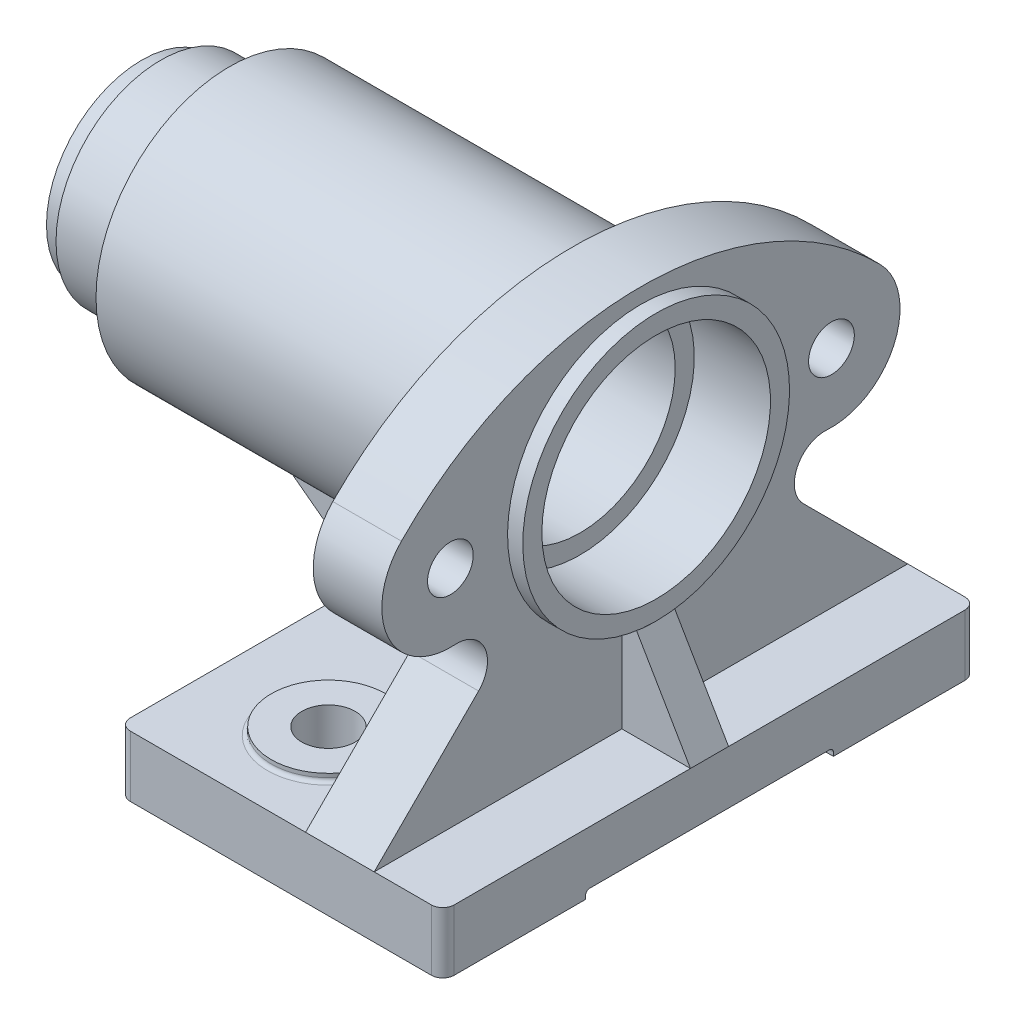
from build123d import *

# Parameters (mm, degrees)
SKETCH_1_W          = 85
SKETCH_1_H          = 16
EXTRUDE_2_DEPTH     = 70
SKETCH_3_R          = 6
SKETCH_3_R_2        = 35
EXTRUDE_3_DEPTH     = 18
RIB_1_REACH         = 202.248
SKETCH_4_WALL_W     = 430.28121444
SKETCH_4_WALL_H     = 10
RIB_2_REACH         = 202.248
SKETCH_5_WALL_W     = 442.49632646
SKETCH_5_WALL_H     = 10
SKETCH_7_R          = 15
EXTRUDE_4_DEPTH     = 2
SKETCH_8_R          = 7
CUT_EXTRUDE_1_DEPTH = 22
SKETCH_10_W         = 65
SKETCH_10_H         = 2
CUT_EXTRUDE_2_DEPTH = 92
FILLET_2_R          = 3
FILLET_3_R          = 1


with BuildPart() as part:
    # Sketch 1 → Extrude 2 (new, symmetric)
    with BuildSketch(Plane.XY):
        with Locations((-42.5, 8)):
            Rectangle(SKETCH_1_W, SKETCH_1_H)
    extrude(amount=EXTRUDE_2_DEPTH, both=True)



with BuildPart() as body_2:
    # Sketch 2 → Revolve 2 (revolve)
    with BuildSketch(Plane.XY, mode=Mode.PRIVATE) as revolve_2_sk:
        Polygon((-149, 91), (-149, 100), (-144, 100), (-144, 102.5), (-126, 102.5), (-126, 110), (-14, 110), (-14, 105), (-34, 105), (-34, 100), (-114, 100), (-114, 91), align=None)
    revolve(revolve_2_sk.sketch.rotate(Axis((-107.067924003, 75, 0), (1, 0, 0)), 90), axis=Axis((-107.067924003, 75, 0), (1, 0, 0)))


with BuildPart() as part_1:
    add(part.part)

    add(body_2.part)  # Extrude 3 merges body 2
    # Sketch 3 → Extrude 3 (add)
    with BuildSketch(Plane(origin=(-18, 0, 0), x_dir=(0, 0, -1), z_dir=(1, 0, 0))):
        with BuildLine():
            Line((-70, 16), (-42.598236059, 43.401763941))
            ThreePointArc((-42.598236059, 43.401763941), (-40.971009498, 52.366512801), (-48.791985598, 57.040581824))
            ThreePointArc((-48.791985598, 57.040581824), (-66.35099273, 67.473710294), (-62.857142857, 87.59737582))
            ThreePointArc((-62.857142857, 87.59737582), (0, 114.010205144), (62.857142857, 87.59737582))
            ThreePointArc((62.857142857, 87.59737582), (66.35099273, 67.473710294), (48.791985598, 57.040581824))
            ThreePointArc((48.791985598, 57.040581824), (40.971009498, 52.366512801), (42.598236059, 43.401763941))
            Line((42.598236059, 43.401763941), (70, 16))
            Line((70, 16), (-70, 16))
        make_face()
        with Locations((-50, 75)):
            Circle(SKETCH_3_R, mode=Mode.SUBTRACT)
        with Locations(Location((50, 75, 0), (0, 0, 180))):
            Circle(SKETCH_3_R, mode=Mode.SUBTRACT)
        with Locations(Location((0, 75, 0), (0, 0, 180))):
            Circle(SKETCH_3_R_2, mode=Mode.SUBTRACT)
    extrude(amount=-EXTRUDE_3_DEPTH)

    # Sketch 4 wall → Rib 1 (add, up to next)
    with BuildSketch(Plane(origin=(-7, 28, 0), x_dir=(-0.503871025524, 0.863778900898, 0), z_dir=(-0.863778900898, -0.503871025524, 0)), mode=Mode.PRIVATE) as rib_1_sk1:
        Rectangle(SKETCH_4_WALL_W, SKETCH_4_WALL_H)
    rib_1_tool1 = extrude(rib_1_sk1.sketch, amount=RIB_1_REACH, mode=Mode.PRIVATE) - part_1.part
    add(rib_1_tool1.solids().sort_by_distance((-7, 28, 0))[0])

    # Sketch 5 wall → Rib 2 (add, up to next)
    with BuildSketch(Plane(origin=(-101, 28, 0), x_dir=(-0.8, 0.6, 0), z_dir=(-0.6, -0.8, 0)), mode=Mode.PRIVATE) as rib_2_sk1:
        Rectangle(SKETCH_5_WALL_W, SKETCH_5_WALL_H)
    rib_2_tool1 = extrude(rib_2_sk1.sketch, amount=-RIB_2_REACH, mode=Mode.PRIVATE) - part_1.part
    add(rib_2_tool1.solids().sort_by_distance((-101, 28, 0))[0])

    # Sketch 7 → Extrude 4 (add)
    with BuildSketch(Plane(origin=(0, 16, 0), x_dir=(1, 0, 0), z_dir=(0, 1, 0))):
        with Locations((-55, 45)):
            Circle(SKETCH_7_R)
        with Locations((-55, -45)):
            Circle(SKETCH_7_R)
    extrude(amount=EXTRUDE_4_DEPTH)

    # Sketch 8 → Cut-Extrude 1 (cut)
    with BuildSketch(Plane(origin=(0, 18, 0), x_dir=(1, 0, 0), z_dir=(0, 1, 0))):
        with Locations(Location((-55, 45, 0), (0, 0, 180))):
            Circle(SKETCH_8_R)
        with Locations(Location((-55, -45, 0), (0, 0, 180))):
            Circle(SKETCH_8_R)
    extrude(amount=-CUT_EXTRUDE_1_DEPTH, mode=Mode.SUBTRACT)

    # Sketch 10 → Cut-Extrude 2 (cut)
    with BuildSketch(Plane(origin=(0, 0, 0), x_dir=(0, 0, -1), z_dir=(1, 0, 0))):
        with Locations((0, 1)):
            Rectangle(SKETCH_10_W, SKETCH_10_H)
    extrude(amount=-CUT_EXTRUDE_2_DEPTH, mode=Mode.SUBTRACT)

    # Fillet 2
    fillet_2_edges = [part_1.edges().sort_by_distance(p)[0] for p in [
        (-85, 8, 70),
        (-85, 8, -70),
        (0, 8, -70),
        (0, 8, 70),
    ]]
    fillet(fillet_2_edges, radius=FILLET_2_R)

    # Fillet 3
    fillet_3_edges = [part_1.edges().sort_by_distance(p)[0] for p in [
        (-70, 16, -45),
        (-70, 16, 45),
        (-42.5, 2, 32.5),
        (-42.5, 2, -32.5),
    ]]
    fillet(fillet_3_edges, radius=FILLET_3_R)


solid = part_1.part
